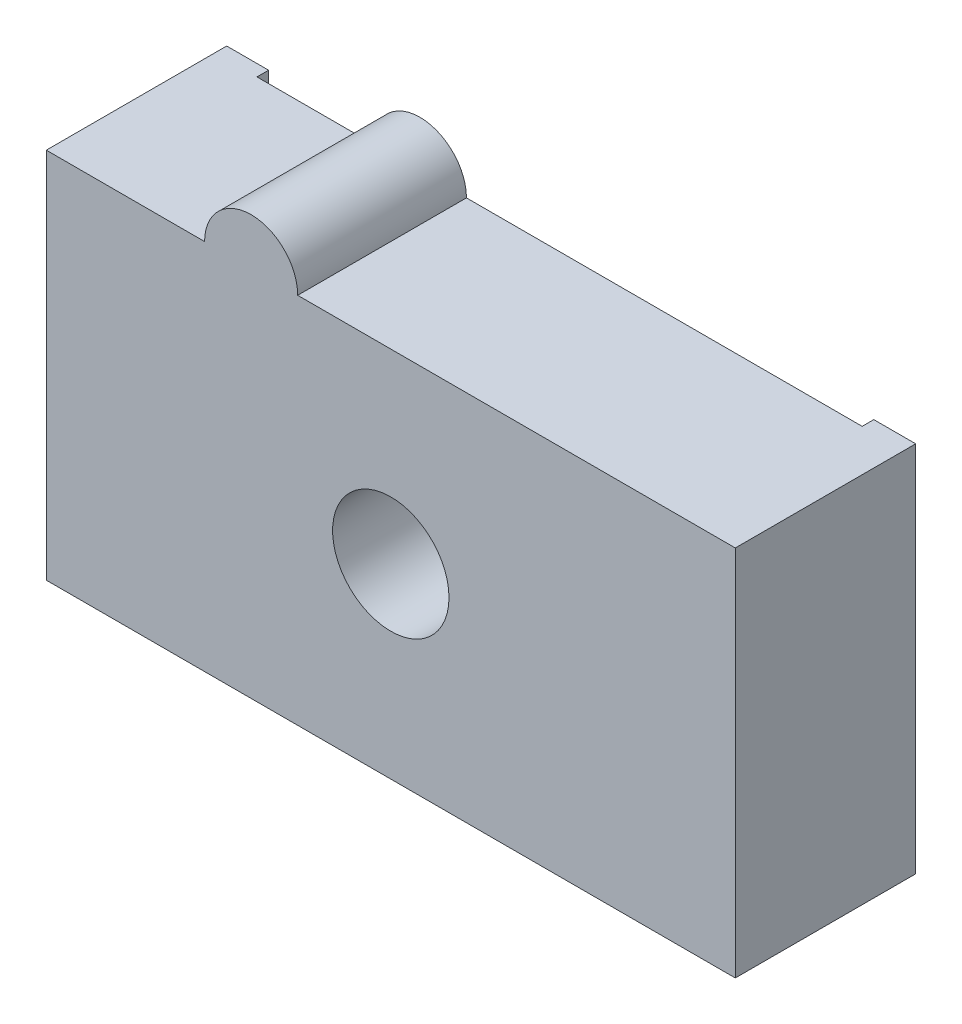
from build123d import *

# Parameters (mm, degrees)
BASE_EXTRUSION_DEPTH    = 3.875
ESQUISSE2_R             = 1
ENL_V_MAT_EXTRU_1_DEPTH = 3
ESQUISSE3_R             = 1.25
ENL_V_MAT_EXTRU_2_DEPTH = 20.843780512
ESQUISSE4_W             = 13
ESQUISSE4_H             = 12
ENL_V_MAT_EXTRU_3_DEPTH = 0.25


with BuildPart() as part:
    # Esquisse1 → Base-Extrusion (new body)
    with BuildSketch(Plane.XY):
        with BuildLine():
            Line((-2, -10), (7.4, -10))
            Line((7.4, -10), (7.4, -18))
            Line((7.4, -18), (-7.4, -18))
            Line((-7.4, -18), (-7.4, -10))
            Line((-7.4, -10), (-4, -10))
            ThreePointArc((-4, -10), (-3, -9), (-2, -10))
        make_face()
    extrude(amount=BASE_EXTRUSION_DEPTH)

    # Esquisse2 → Enl_v. mat.-Extru.1 (cut)
    with BuildSketch(Plane(origin=(0, 0, 0), x_dir=(-1, 0, 0), z_dir=(0, 0, -1))):
        with Locations((-4.993776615, -11.695180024)):
            Circle(ESQUISSE2_R)
        with Locations((4.993776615, -16.304819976)):
            Circle(ESQUISSE2_R)
    extrude(amount=-ENL_V_MAT_EXTRU_1_DEPTH, mode=Mode.SUBTRACT)

    # Esquisse3 → Enl_v. mat.-Extru.2 (cut, through all)
    with BuildSketch(Plane.XY.offset(3.875)):
        with Locations((0, -14)):
            Circle(ESQUISSE3_R)
    extrude(amount=-ENL_V_MAT_EXTRU_2_DEPTH, mode=Mode.SUBTRACT)

    # Esquisse4 → Enl_v. mat.-Extru.3 (cut)
    with BuildSketch(Plane(origin=(0, 0, 0), x_dir=(-1, 0, 0), z_dir=(0, 0, -1))):
        with Locations((0, -12)):
            Rectangle(ESQUISSE4_W, ESQUISSE4_H)
    extrude(amount=-ENL_V_MAT_EXTRU_3_DEPTH, mode=Mode.SUBTRACT)


solid = part.part
